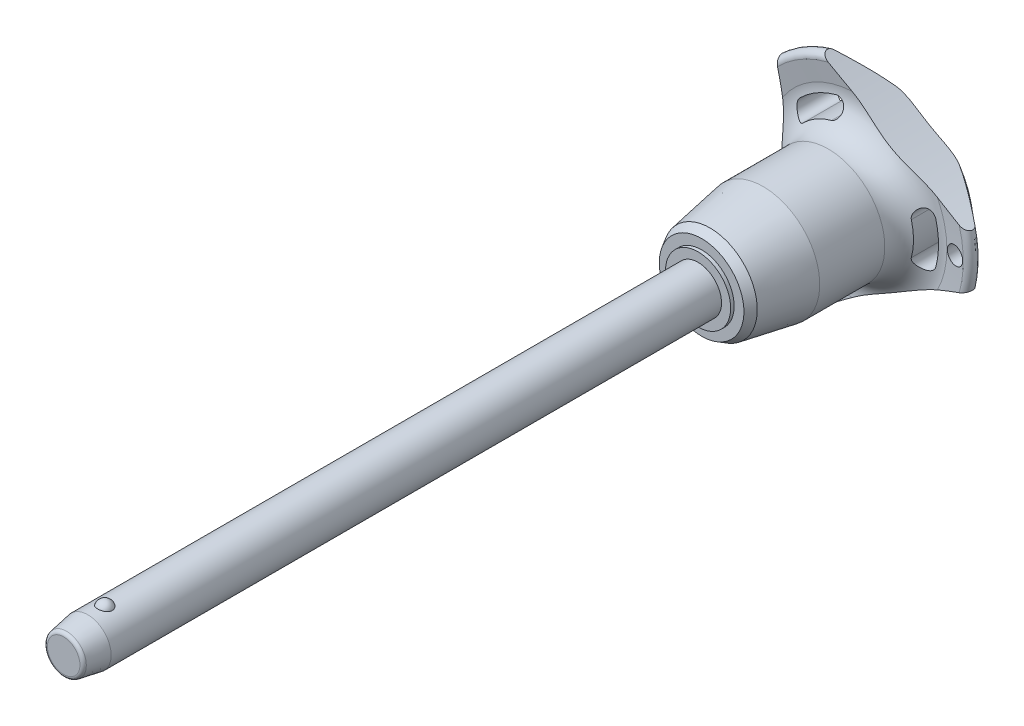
from build123d import *

# Parameters (mm, degrees)
SKETCH1_R           = 4
BOSS_EXTRUDE1_DEPTH = 100
SKETCH2_R           = 3.4
BOSS_EXTRUDE2_DEPTH = 33.3
BOSS_EXTRUDE3_START = 8.2
SKETCH1_2_R         = 4
BOSS_EXTRUDE3_DEPTH = 8.2
CHAMFER1_SIZE       = 4.1
CHAMFER1_SIZE2      = 0.722940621
FILLET1_R           = 0.6
SKETCH6_R           = 102.8
CUT_EXTRUDE1_DEPTH  = 137.15495075
CIRPATTERN1_COUNT   = 3
SKETCH7_R           = 1.5
CUT_EXTRUDE2_DEPTH  = 137.036109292


with BuildPart() as part:
    # Sketch1 → Boss-Extrude1 (new body)
    with BuildSketch(Plane.XY):
        Circle(SKETCH1_R)
    extrude(amount=-BOSS_EXTRUDE1_DEPTH)

    # Sketch2 → Boss-Extrude2 (add)
    with BuildSketch(Plane(origin=(0, 0, -100), x_dir=(-1, 0, 0), z_dir=(0, 0, -1))):
        Circle(SKETCH2_R)
    extrude(amount=BOSS_EXTRUDE2_DEPTH)

    # Sketch3 → Revolve1 (revolve)
    with BuildSketch(Plane(origin=(0, 0, 0), x_dir=(0, 0, -1), z_dir=(1, 0, 0))):
        with BuildLine():
            Line((-1.2, 4.8), (-1.2, 2.2))
            ThreePointArc((-1.2, 2.2), (0.1, 3.5), (-1.2, 4.8))
        make_face()
        with BuildLine():
            Line((-1.2, -2.2), (-1.2, -4.8))
            ThreePointArc((-1.2, -4.8), (0.1, -3.5), (-1.2, -2.2))
        make_face()
    revolve(axis=Axis((0, -2.2, 1.2), (0, 1, 0)))

    # Sketch1_2 → Boss-Extrude3 (add)
    with BuildSketch(Plane.XY.offset(BOSS_EXTRUDE3_START)):
        Circle(SKETCH1_2_R)
    extrude(amount=-BOSS_EXTRUDE3_DEPTH)

    # Chamfer1
    chamfer1_edges = [part.edges().sort_by_distance(p)[0] for p in [
        (-4, 0, 8.2),
    ]]
    chamfer1_side = [part.faces().sort_by_distance(p)[0] for p in [
        (-4, 0, -45.9),
    ]]
    chamfer(chamfer1_edges, length=CHAMFER1_SIZE, length2=CHAMFER1_SIZE2, reference=chamfer1_side[0])

    # Fillet1
    fillet1_edges = [part.edges().sort_by_distance(p)[0] for p in [
        (-3.277059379, 0, 8.2),
        (3.4, 0, -133.3),
    ]]
    fillet(fillet1_edges, radius=FILLET1_R)

    # Sketch4 → Revolve2 (revolve)
    with BuildSketch(Plane(origin=(0, 0, 0), x_dir=(0, 0, -1), z_dir=(1, 0, 0)), mode=Mode.PRIVATE) as revolve2_sk:
        Polygon((100, 0), (100, 5.554101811), (100.6, 5.554101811), (100.6, 7.220004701), (102.042714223, 8.052956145), (111.1, 9.65), (122.2, 9.65), (122.2, 0), align=None)
    revolve(revolve2_sk.sketch.rotate(Axis((0, 0, -122.2), (0, 0, 1)), 90), axis=Axis((0, 0, -122.2), (0, 0, 1)))

    # Sketch5 → Revolve3 (revolve)
    with BuildSketch(Plane(origin=(0, 0, 0), x_dir=(0, 0, -1), z_dir=(1, 0, 0)), mode=Mode.PRIVATE) as revolve3_sk:
        with BuildLine():
            Line((127.16082631, 15.274661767), (126.757834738, 18.475067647))
            ThreePointArc((126.757834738, 18.475067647), (127.349836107, 19.516443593), (128.516044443, 19.24278761))
            Line((128.516044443, 19.24278761), (132.835691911, 14.094832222))
            ThreePointArc((132.835691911, 14.094832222), (133.3, 12.689260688), (132.67067517, 11.349423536))
            ThreePointArc((132.67067517, 11.349423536), (129.033110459, 6.185112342), (127.75, 0))
            Line((127.75, 0), (122.2, 0))
            Line((122.2, 0), (122.2, 9.65))
            ThreePointArc((122.2, 9.65), (125.949887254, 11.342683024), (127.16082631, 15.274661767))
        make_face()
    revolve(revolve3_sk.sketch.rotate(Axis((0, 0, -127.75), (0, 0, 1)), 90), axis=Axis((0, 0, -127.75), (0, 0, 1)))

    # Sketch6 → Cut-Extrude1 (cut, through all)
    with BuildSketch(Plane.XY):
        with Locations((-115.2, 0)):
            Circle(SKETCH6_R)
        with BuildLine():
            ThreePointArc((13.411913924, -3.529271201), (13.868496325, 0), (13.411913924, 3.529271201))
            ThreePointArc((13.411913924, 3.529271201), (11.694200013, 4.531299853), (10.692171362, 2.813585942))
            ThreePointArc((10.692171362, 2.813585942), (11.056165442, 0), (10.692171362, -2.813585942))
            ThreePointArc((10.692171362, -2.813585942), (11.694200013, -4.531299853), (13.411913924, -3.529271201))
        make_face()
    cut_extrude1 = extrude(amount=-CUT_EXTRUDE1_DEPTH, mode=Mode.SUBTRACT)

    # CirPattern1: Cut-Extrude1 ×3 about axis
    cirpattern1_axis = Axis((0, 0, 0), (0, 0, 1))
    for i in range(1, CIRPATTERN1_COUNT):
        add(cut_extrude1.rotate(cirpattern1_axis, i * 360 / CIRPATTERN1_COUNT), mode=Mode.SUBTRACT)

    # Sketch7 → Cut-Extrude2 (cut, through all)
    with BuildSketch(Plane.XY):
        with Locations(Location((16.868496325, 0, 0), (0, 0, 225.467095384))):
            Circle(SKETCH7_R)
    extrude(amount=-CUT_EXTRUDE2_DEPTH, mode=Mode.SUBTRACT)


solid = part.part
